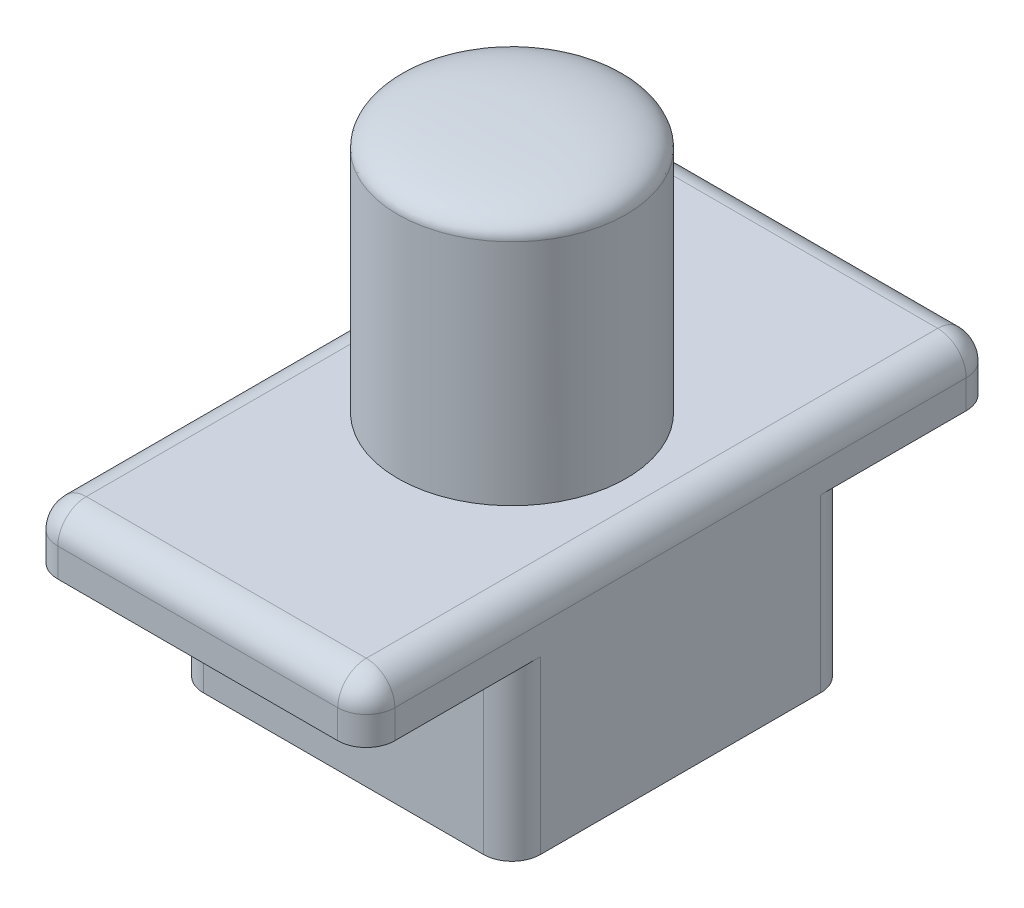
from build123d import *

# Parameters (mm, degrees)
EXTRUDE1_DEPTH     = 2.95
SKETCH2_R          = 2
EXTRUDE2_DEPTH     = 4
FILLET1_R          = 0.5
SKETCH4_W          = 3.9978
SKETCH4_H          = 3.9978
CUT_EXTRUDE1_DEPTH = 2.8
SKETCH5_R          = 0.75
CUT_EXTRUDE2_DEPTH = 0.2


with BuildPart() as part:
    # Sketch1 → Extrude1 (new, symmetric)
    with BuildSketch(Plane(origin=(0, 0, 0), x_dir=(0, 0, -1), z_dir=(1, 0, 0))):
        Polygon((-5.5, 4), (5.5, 4), (5.5, 3), (2.95, 3), (2.95, 0), (-2.95, 0), (-2.95, 3), (-5.5, 3), align=None)
    extrude(amount=EXTRUDE1_DEPTH, both=True)

    # Sketch2 → Extrude2 (add)
    with BuildSketch(Plane(origin=(0, 4, 0), x_dir=(1, 0, 0), z_dir=(0, 1, 0))):
        with Locations(Location((0, 0, 0), (0, 0, 90))):
            Circle(SKETCH2_R)
    extrude(amount=EXTRUDE2_DEPTH)

    # Sketch3 → Revolve1 (revolve)
    with BuildSketch(Plane.XY):
        with BuildLine():
            Line((0, 8), (2, 8))
            add(Edge.make_bspline(
                [(0, 8.500000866), (0.210223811, 8.499997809), (0.519523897, 8.493957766), (0.913581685, 8.467562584), (1.197251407, 8.435892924), (1.464866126, 8.388168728), (1.66873988, 8.32926061), (1.812485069, 8.262780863), (1.906735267, 8.199362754), (1.975845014, 8.118373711), (2.000420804, 8.045407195), (2, 8)],
                knots=[0, 0, 0, 0, 0.25, 0.375, 0.5, 0.625, 0.75, 0.8125, 0.875, 0.9375, 0.990999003, 0.990999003, 0.990999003, 0.990999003], degree=3))
            Line((0, 8.500000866), (0, 8))
        make_face()
    revolve(axis=Axis((0, 8, 0), (0, 1, 0)))

    # Fillet1
    fillet1_edges = [part.edges().sort_by_distance(p)[0] for p in [
        (2.95, 3.5, -5.5),
        (2.95, 4, 0),
        (0, 4, 5.5),
        (0, 4, -5.5),
        (2.95, 3.5, 5.5),
        (2.95, 1.5, 2.95),
        (2.95, 1.5, -2.95),
        (-2.95, 1.5, 2.95),
        (-2.95, 3.5, 5.5),
        (-2.95, 4, 0),
        (-2.95, 3.5, -5.5),
        (-2.95, 1.5, -2.95),
    ]]
    fillet(fillet1_edges, radius=FILLET1_R)

    # Sketch4 → Cut-Extrude1 (cut)
    with BuildSketch(Plane.XZ):
        Rectangle(SKETCH4_W, SKETCH4_H)
    extrude(amount=-CUT_EXTRUDE1_DEPTH, mode=Mode.SUBTRACT)

    # Sketch5 → Cut-Extrude2 (cut)
    with BuildSketch(Plane.XZ.offset(-2.8)):
        with Locations(Location((0, 0, 0), (0, 0, 270))):
            Circle(SKETCH5_R)
    extrude(amount=-CUT_EXTRUDE2_DEPTH, mode=Mode.SUBTRACT)


solid = part.part
